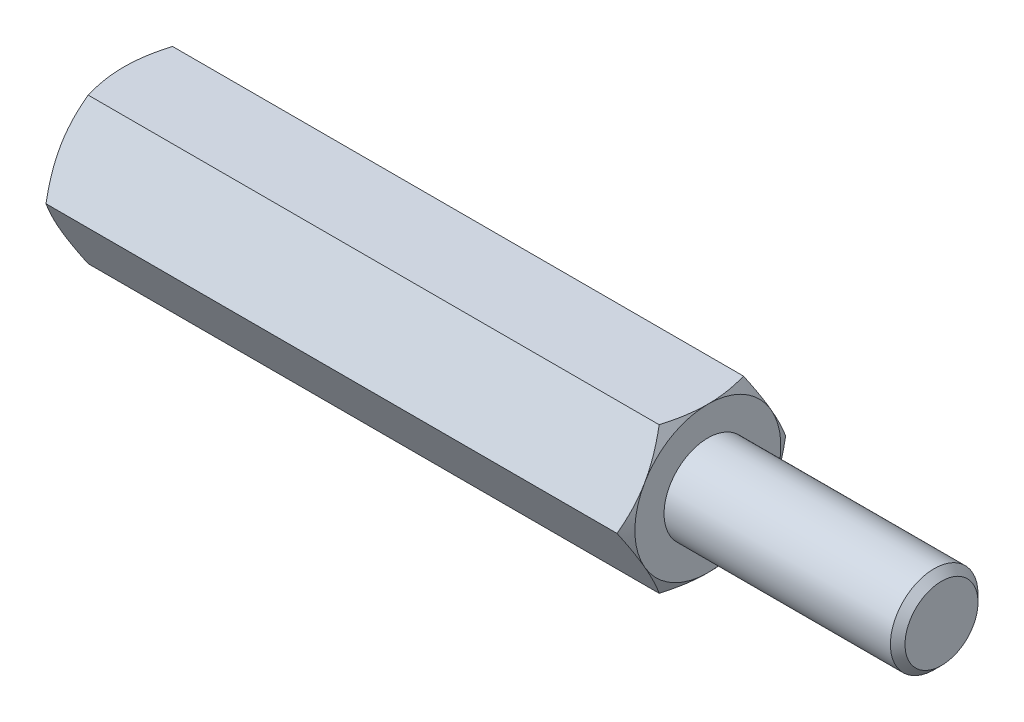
ISO-10303-21;
HEADER;
FILE_DESCRIPTION(('STEP AP214'),'2;1');
FILE_NAME('part.step','',(''),(''),'','','');
FILE_SCHEMA(('AUTOMOTIVE_DESIGN { 1 0 10303 214 1 1 1 1 }'));
ENDSEC;
DATA;
#1=APPLICATION_CONTEXT('core data for automotive mechanical design processes');
#2=APPLICATION_PROTOCOL_DEFINITION('international standard','automotive_design',2000,#1);
#3=PRODUCT_CONTEXT('',#1,'mechanical');
#4=PRODUCT('Part','Part','',(#3));
#5=PRODUCT_RELATED_PRODUCT_CATEGORY('part','',(#4));
#6=PRODUCT_DEFINITION_FORMATION('','',#4);
#7=PRODUCT_DEFINITION_CONTEXT('part definition',#1,'design');
#8=PRODUCT_DEFINITION('design','',#6,#7);
#9=PRODUCT_DEFINITION_SHAPE('','',#8);
#10=(LENGTH_UNIT() NAMED_UNIT(*) SI_UNIT(.MILLI.,.METRE.));
#11=(NAMED_UNIT(*) PLANE_ANGLE_UNIT() SI_UNIT($,.RADIAN.));
#12=(NAMED_UNIT(*) SI_UNIT($,.STERADIAN.) SOLID_ANGLE_UNIT());
#13=UNCERTAINTY_MEASURE_WITH_UNIT(LENGTH_MEASURE(1.E-05),#10,'distance_accuracy_value','');
#14=(GEOMETRIC_REPRESENTATION_CONTEXT(3) GLOBAL_UNCERTAINTY_ASSIGNED_CONTEXT((#13)) GLOBAL_UNIT_ASSIGNED_CONTEXT((#10,
#11,#12)) REPRESENTATION_CONTEXT('',''));
#15=CARTESIAN_POINT('',(0.,0.,0.));
#16=DIRECTION('',(0.,0.,1.));
#17=DIRECTION('',(1.,0.,0.));
#18=AXIS2_PLACEMENT_3D('',#15,#16,#17);
#19=CARTESIAN_POINT('',(10.,2.5,-1.44337567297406));
#20=DIRECTION('',(1.,0.,0.));
#21=DIRECTION('',(0.,0.,-1.));
#22=AXIS2_PLACEMENT_3D('',#19,#20,#21);
#23=PLANE('',#22);
#24=CARTESIAN_POINT('',(10.,0.,0.));
#25=DIRECTION('',(1.,0.,0.));
#26=DIRECTION('',(0.,0.,-1.));
#27=AXIS2_PLACEMENT_3D('',#24,#25,#26);
#28=CIRCLE('',#27,2.5);
#29=CARTESIAN_POINT('',(10.,-1.25,-2.1650635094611));
#30=VERTEX_POINT('',#29);
#31=CARTESIAN_POINT('',(10.,1.25,-2.1650635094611));
#32=VERTEX_POINT('',#31);
#33=EDGE_CURVE('E288',#30,#32,#28,.T.);
#34=ORIENTED_EDGE('',*,*,#33,.T.);
#35=CARTESIAN_POINT('',(10.,2.5,0.));
#36=VERTEX_POINT('',#35);
#37=EDGE_CURVE('E53',#32,#36,#28,.T.);
#38=ORIENTED_EDGE('',*,*,#37,.T.);
#39=CARTESIAN_POINT('',(10.,1.25,2.1650635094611));
#40=VERTEX_POINT('',#39);
#41=EDGE_CURVE('E296',#36,#40,#28,.T.);
#42=ORIENTED_EDGE('',*,*,#41,.T.);
#43=CARTESIAN_POINT('',(10.,-1.25,2.1650635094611));
#44=VERTEX_POINT('',#43);
#45=EDGE_CURVE('E301',#40,#44,#28,.T.);
#46=ORIENTED_EDGE('',*,*,#45,.T.);
#47=CARTESIAN_POINT('',(10.,0.,0.));
#48=DIRECTION('',(-1.,0.,0.));
#49=DIRECTION('',(0.,-1.,0.));
#50=AXIS2_PLACEMENT_3D('',#47,#48,#49);
#51=CIRCLE('',#50,2.5);
#52=CARTESIAN_POINT('',(10.,-2.5,0.));
#53=VERTEX_POINT('',#52);
#54=EDGE_CURVE('E193',#53,#44,#51,.T.);
#55=ORIENTED_EDGE('',*,*,#54,.F.);
#56=EDGE_CURVE('E61',#53,#30,#28,.T.);
#57=ORIENTED_EDGE('',*,*,#56,.T.);
#58=EDGE_LOOP('',(#34,#38,#42,#46,#55,#57));
#59=FACE_BOUND('',#58,.T.);
#60=CARTESIAN_POINT('',(10.,0.,0.));
#61=DIRECTION('',(1.,0.,0.));
#62=DIRECTION('',(0.,0.,-1.));
#63=AXIS2_PLACEMENT_3D('',#60,#61,#62);
#64=CIRCLE('',#63,1.5);
#65=CARTESIAN_POINT('',(10.,0.,-1.5));
#66=VERTEX_POINT('',#65);
#67=EDGE_CURVE('E329',#66,#66,#64,.T.);
#68=ORIENTED_EDGE('',*,*,#67,.F.);
#69=EDGE_LOOP('',(#68));
#70=FACE_BOUND('',#69,.T.);
#71=ADVANCED_FACE('F37',(#59,#70),#23,.T.);
#72=CARTESIAN_POINT('',(10.,0.,-2.88675134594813));
#73=DIRECTION('',(0.,-0.5,0.866025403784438));
#74=DIRECTION('',(0.,-0.866025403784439,-0.5));
#75=AXIS2_PLACEMENT_3D('',#72,#73,#74);
#76=PLANE('',#75);
#77=CARTESIAN_POINT('',(9.7766423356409,-0.00019999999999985,-2.88686681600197));
#78=CARTESIAN_POINT('',(9.81327837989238,0.109663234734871,-2.82343724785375));
#79=CARTESIAN_POINT('',(9.84659778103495,0.220474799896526,-2.75946016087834));
#80=CARTESIAN_POINT('',(9.90475771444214,0.444016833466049,-2.63039810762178));
#81=CARTESIAN_POINT('',(9.92957767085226,0.556751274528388,-2.5653108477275));
#82=CARTESIAN_POINT('',(9.96821434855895,0.780822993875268,-2.43594298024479));
#83=CARTESIAN_POINT('',(9.98228820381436,0.892125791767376,-2.37168227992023));
#84=CARTESIAN_POINT('',(9.99909084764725,1.11525522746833,-2.24285844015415));
#85=CARTESIAN_POINT('',(10.0018335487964,1.22708105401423,-2.17829576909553));
#86=CARTESIAN_POINT('',(9.99613423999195,1.43604197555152,-2.05765212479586));
#87=CARTESIAN_POINT('',(9.98909160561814,1.53320831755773,-2.0015531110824));
#88=CARTESIAN_POINT('',(9.96676858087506,1.726907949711,-1.88972057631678));
#89=CARTESIAN_POINT('',(9.95148056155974,1.82344056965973,-1.8339874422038));
#90=CARTESIAN_POINT('',(9.91326090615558,2.01753972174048,-1.7219242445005));
#91=CARTESIAN_POINT('',(9.89016722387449,2.11508168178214,-1.66560836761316));
#92=CARTESIAN_POINT('',(9.83775334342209,2.30871060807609,-1.55381665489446));
#93=CARTESIAN_POINT('',(9.80844546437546,2.40480005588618,-1.49833938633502));
#94=CARTESIAN_POINT('',(9.7766423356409,2.5002,-1.44326020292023));
#95=B_SPLINE_CURVE_WITH_KNOTS('',3,(#77,#78,#79,#80,#81,#82,#83,#84,#85,#86,#87,#88,#89,#90,#91,
#92,#93,#94),.UNSPECIFIED.,.F.,.F.,(4,2,2,2,2,2,2,2,4),(0.,0.396285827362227,0.79352433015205,
1.18093086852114,1.56786160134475,1.90479741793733,2.24204551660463,2.58677531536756,
2.93082800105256),.UNSPECIFIED.);
#96=CARTESIAN_POINT('',(9.7767090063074,0.,-2.88675134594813));
#97=VERTEX_POINT('',#96);
#98=EDGE_CURVE('E336',#97,#32,#95,.T.);
#99=ORIENTED_EDGE('',*,*,#98,.F.);
#100=DIRECTION('',(-1.,0.,0.));
#101=VECTOR('',#100,1.);
#102=CARTESIAN_POINT('',(10.,0.,-2.88675134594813));
#103=LINE('',#102,#101);
#104=CARTESIAN_POINT('',(-9.7767090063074,0.,-2.88675134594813));
#105=VERTEX_POINT('',#104);
#106=EDGE_CURVE('E264',#97,#105,#103,.T.);
#107=ORIENTED_EDGE('',*,*,#106,.T.);
#108=CARTESIAN_POINT('',(-9.7766423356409,2.5002,-1.44326020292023));
#109=CARTESIAN_POINT('',(-9.81327837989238,2.39033676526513,-1.50668977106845));
#110=CARTESIAN_POINT('',(-9.84659778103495,2.27952520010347,-1.57066685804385));
#111=CARTESIAN_POINT('',(-9.90475771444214,2.05598316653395,-1.69972891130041));
#112=CARTESIAN_POINT('',(-9.92957767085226,1.94324872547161,-1.7648161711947));
#113=CARTESIAN_POINT('',(-9.96821434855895,1.71917700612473,-1.8941840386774));
#114=CARTESIAN_POINT('',(-9.98228820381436,1.60787420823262,-1.95844473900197));
#115=CARTESIAN_POINT('',(-9.99909084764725,1.38474477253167,-2.08726857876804));
#116=CARTESIAN_POINT('',(-10.0018335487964,1.27291894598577,-2.15183124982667));
#117=CARTESIAN_POINT('',(-9.99613423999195,1.06395802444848,-2.27247489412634));
#118=CARTESIAN_POINT('',(-9.98909160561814,0.96679168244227,-2.32857390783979));
#119=CARTESIAN_POINT('',(-9.96676858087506,0.773092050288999,-2.44040644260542));
#120=CARTESIAN_POINT('',(-9.95148056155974,0.676559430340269,-2.49613957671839));
#121=CARTESIAN_POINT('',(-9.91326090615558,0.482460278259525,-2.60820277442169));
#122=CARTESIAN_POINT('',(-9.89016722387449,0.38491831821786,-2.66451865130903));
#123=CARTESIAN_POINT('',(-9.83775334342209,0.191289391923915,-2.77631036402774));
#124=CARTESIAN_POINT('',(-9.80844546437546,0.0951999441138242,-2.83178763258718));
#125=CARTESIAN_POINT('',(-9.7766423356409,-0.000199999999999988,-2.88686681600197));
#126=B_SPLINE_CURVE_WITH_KNOTS('',3,(#108,#109,#110,#111,#112,#113,#114,#115,#116,#117,#118,
#119,#120,#121,#122,#123,#124,#125),.UNSPECIFIED.,.F.,.F.,(4,2,2,2,2,2,2,2,4),(0.,
0.396285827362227,0.79352433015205,1.18093086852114,1.56786160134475,1.90479741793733,
2.24204551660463,2.58677531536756,2.93082800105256),.UNSPECIFIED.);
#127=CARTESIAN_POINT('',(-10.,1.25,-2.1650635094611));
#128=VERTEX_POINT('',#127);
#129=EDGE_CURVE('E321',#128,#105,#126,.T.);
#130=ORIENTED_EDGE('',*,*,#129,.F.);
#131=CARTESIAN_POINT('',(-9.7767090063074,2.5,-1.44337567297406));
#132=VERTEX_POINT('',#131);
#133=EDGE_CURVE('E311',#132,#128,#126,.T.);
#134=ORIENTED_EDGE('',*,*,#133,.F.);
#135=DIRECTION('',(-1.,0.,0.));
#136=VECTOR('',#135,1.);
#137=CARTESIAN_POINT('',(10.,2.5,-1.44337567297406));
#138=LINE('',#137,#136);
#139=CARTESIAN_POINT('',(9.77670900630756,2.5,-1.44337567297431));
#140=VERTEX_POINT('',#139);
#141=EDGE_CURVE('E279',#140,#132,#138,.T.);
#142=ORIENTED_EDGE('',*,*,#141,.F.);
#143=EDGE_CURVE('E229',#32,#140,#95,.T.);
#144=ORIENTED_EDGE('',*,*,#143,.F.);
#145=EDGE_LOOP('',(#99,#107,#130,#134,#142,#144));
#146=FACE_BOUND('',#145,.T.);
#147=ADVANCED_FACE('F148',(#146),#76,.F.);
#148=CARTESIAN_POINT('',(10.,2.5,-1.44337567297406));
#149=DIRECTION('',(0.,-1.,0.));
#150=DIRECTION('',(0.,0.,-1.));
#151=AXIS2_PLACEMENT_3D('',#148,#149,#150);
#152=PLANE('',#151);
#153=CARTESIAN_POINT('',(8.76803388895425,2.5,-3.90158441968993));
#154=CARTESIAN_POINT('',(8.82120772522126,2.5,-3.79217004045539));
#155=CARTESIAN_POINT('',(8.87387869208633,2.5,-3.68250707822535));
#156=CARTESIAN_POINT('',(8.97793249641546,2.5,-3.46255185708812));
#157=CARTESIAN_POINT('',(9.02931513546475,2.5,-3.35225950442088));
#158=CARTESIAN_POINT('',(9.13076309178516,2.5,-3.130356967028));
#159=CARTESIAN_POINT('',(9.18081992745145,2.5,-3.01874289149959));
#160=CARTESIAN_POINT('',(9.27891712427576,2.5,-2.79463535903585));
#161=CARTESIAN_POINT('',(9.32695757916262,2.5,-2.68214194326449));
#162=CARTESIAN_POINT('',(9.42201845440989,2.5,-2.45240385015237));
#163=CARTESIAN_POINT('',(9.46895431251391,2.5,-2.33512399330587));
#164=CARTESIAN_POINT('',(9.55933269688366,2.5,-2.09920133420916));
#165=CARTESIAN_POINT('',(9.60277483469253,2.5,-1.98055838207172));
#166=CARTESIAN_POINT('',(9.68504351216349,2.5,-1.74193489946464));
#167=CARTESIAN_POINT('',(9.72387917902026,2.5,-1.6219575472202));
#168=CARTESIAN_POINT('',(9.79570507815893,2.5,-1.38028205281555));
#169=CARTESIAN_POINT('',(9.82869712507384,2.5,-1.25858445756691));
#170=CARTESIAN_POINT('',(9.88709594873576,2.5,-1.01406369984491));
#171=CARTESIAN_POINT('',(9.91254379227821,2.5,-0.89125052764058));
#172=CARTESIAN_POINT('',(9.95442751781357,2.5,-0.644071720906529));
#173=CARTESIAN_POINT('',(9.97086432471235,2.5,-0.519706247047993));
#174=CARTESIAN_POINT('',(9.9932006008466,2.5,-0.271679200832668));
#175=CARTESIAN_POINT('',(9.99923751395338,2.5,-0.148030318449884));
#176=CARTESIAN_POINT('',(10.0006256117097,2.5,0.0993395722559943));
#177=CARTESIAN_POINT('',(9.99597656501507,2.5,0.223060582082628));
#178=CARTESIAN_POINT('',(9.97940443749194,2.5,0.432351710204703));
#179=CARTESIAN_POINT('',(9.97010665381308,2.5,0.518143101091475));
#180=CARTESIAN_POINT('',(9.94693847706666,2.5,0.689112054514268));
#181=CARTESIAN_POINT('',(9.93306748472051,2.5,0.77428953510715));
#182=CARTESIAN_POINT('',(9.88532020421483,2.5,1.02876599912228));
#183=CARTESIAN_POINT('',(9.84531764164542,2.5,1.19691958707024));
#184=CARTESIAN_POINT('',(9.75226567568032,2.5,1.53362893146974));
#185=CARTESIAN_POINT('',(9.69893620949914,2.5,1.70210423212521));
#186=CARTESIAN_POINT('',(9.61237169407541,2.5,1.95247339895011));
#187=CARTESIAN_POINT('',(9.58242477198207,2.5,2.03553184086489));
#188=CARTESIAN_POINT('',(9.52068409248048,2.5,2.20095860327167));
#189=CARTESIAN_POINT('',(9.48889037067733,2.5,2.2833269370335));
#190=CARTESIAN_POINT('',(9.40401426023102,2.5,2.49723312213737));
#191=CARTESIAN_POINT('',(9.34971733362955,2.5,2.6282879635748));
#192=CARTESIAN_POINT('',(9.2381273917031,2.5,2.88912034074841));
#193=CARTESIAN_POINT('',(9.1808341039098,2.5,3.01889775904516));
#194=CARTESIAN_POINT('',(9.06393487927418,2.5,3.27745045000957));
#195=CARTESIAN_POINT('',(9.00432825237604,2.5,3.40622540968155));
#196=CARTESIAN_POINT('',(8.8833234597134,2.5,3.66293235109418));
#197=CARTESIAN_POINT('',(8.82192524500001,2.5,3.79086430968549));
#198=CARTESIAN_POINT('',(8.63545801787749,2.5,4.17399495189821));
#199=CARTESIAN_POINT('',(8.50828249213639,2.5,4.42816724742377));
#200=CARTESIAN_POINT('',(8.25034557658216,2.5,4.93461464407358));
#201=CARTESIAN_POINT('',(8.11958483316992,2.5,5.18689007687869));
#202=CARTESIAN_POINT('',(7.86871001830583,2.5,5.66512451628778));
#203=CARTESIAN_POINT('',(7.74882986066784,2.5,5.89120644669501));
#204=CARTESIAN_POINT('',(7.50759021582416,2.5,6.34259369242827));
#205=CARTESIAN_POINT('',(7.38623065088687,2.5,6.56789896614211));
#206=CARTESIAN_POINT('',(7.14278038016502,2.5,7.01722044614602));
#207=CARTESIAN_POINT('',(7.02069305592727,2.5,7.24123848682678));
#208=CARTESIAN_POINT('',(6.77566624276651,2.5,7.68878772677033));
#209=CARTESIAN_POINT('',(6.65272681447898,2.5,7.9123189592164));
#210=CARTESIAN_POINT('',(6.52947566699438,2.5,8.13567697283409));
#211=B_SPLINE_CURVE_WITH_KNOTS('',3,(#153,#154,#155,#156,#157,#158,#159,#160,#161,#162,#163,
#164,#165,#166,#167,#168,#169,#170,#171,#172,#173,#174,#175,#176,#177,#178,#179,#180,#181,#182,
#183,#184,#185,#186,#187,#188,#189,#190,#191,#192,#193,#194,#195,#196,#197,#198,#199,#200,#201,
#202,#203,#204,#205,#206,#207,#208,#209,#210),.UNSPECIFIED.,.F.,.F.,(4,2,2,2,2,2,2,2,2,2,2,2,2,
2,2,2,2,2,2,2,2,2,2,2,2,2,2,2,4),(0.,0.364957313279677,0.729970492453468,1.09692930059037,
1.46387103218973,1.84279746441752,2.22176597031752,2.59997058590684,2.97805755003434,
3.35404692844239,3.72999770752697,4.10094071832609,4.47189175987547,4.73064905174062,
4.98944026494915,5.5072907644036,6.03710483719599,6.30196454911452,6.56681915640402,
6.99233818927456,7.41789598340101,7.84358170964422,8.26927907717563,9.12186602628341,
9.97430025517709,10.7419897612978,11.5097197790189,12.2750964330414,13.0404191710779),.UNSPECIFIED.);
#212=EDGE_CURVE('E227',#140,#36,#211,.T.);
#213=ORIENTED_EDGE('',*,*,#212,.F.);
#214=ORIENTED_EDGE('',*,*,#141,.T.);
#215=CARTESIAN_POINT('',(-8.76803388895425,2.5,-3.90158441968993));
#216=CARTESIAN_POINT('',(-8.82120772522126,2.5,-3.79217004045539));
#217=CARTESIAN_POINT('',(-8.87387869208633,2.5,-3.68250707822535));
#218=CARTESIAN_POINT('',(-8.97793249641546,2.5,-3.46255185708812));
#219=CARTESIAN_POINT('',(-9.02931513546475,2.5,-3.35225950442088));
#220=CARTESIAN_POINT('',(-9.13076309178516,2.5,-3.130356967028));
#221=CARTESIAN_POINT('',(-9.18081992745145,2.5,-3.01874289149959));
#222=CARTESIAN_POINT('',(-9.27891712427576,2.5,-2.79463535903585));
#223=CARTESIAN_POINT('',(-9.32695757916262,2.5,-2.68214194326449));
#224=CARTESIAN_POINT('',(-9.42201845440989,2.5,-2.45240385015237));
#225=CARTESIAN_POINT('',(-9.46895431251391,2.5,-2.33512399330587));
#226=CARTESIAN_POINT('',(-9.55933269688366,2.5,-2.09920133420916));
#227=CARTESIAN_POINT('',(-9.60277483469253,2.5,-1.98055838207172));
#228=CARTESIAN_POINT('',(-9.68504351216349,2.5,-1.74193489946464));
#229=CARTESIAN_POINT('',(-9.72387917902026,2.5,-1.6219575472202));
#230=CARTESIAN_POINT('',(-9.79570507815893,2.5,-1.38028205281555));
#231=CARTESIAN_POINT('',(-9.82869712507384,2.5,-1.25858445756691));
#232=CARTESIAN_POINT('',(-9.88709594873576,2.5,-1.01406369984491));
#233=CARTESIAN_POINT('',(-9.91254379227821,2.5,-0.89125052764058));
#234=CARTESIAN_POINT('',(-9.95442751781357,2.5,-0.644071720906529));
#235=CARTESIAN_POINT('',(-9.97086432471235,2.5,-0.519706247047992));
#236=CARTESIAN_POINT('',(-9.9932006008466,2.5,-0.271679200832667));
#237=CARTESIAN_POINT('',(-9.99923751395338,2.5,-0.148030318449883));
#238=CARTESIAN_POINT('',(-10.0006256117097,2.5,0.0993395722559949));
#239=CARTESIAN_POINT('',(-9.99597656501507,2.5,0.223060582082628));
#240=CARTESIAN_POINT('',(-9.97940443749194,2.5,0.432351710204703));
#241=CARTESIAN_POINT('',(-9.97010665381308,2.5,0.518143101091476));
#242=CARTESIAN_POINT('',(-9.94693847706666,2.5,0.689112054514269));
#243=CARTESIAN_POINT('',(-9.93306748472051,2.5,0.774289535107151));
#244=CARTESIAN_POINT('',(-9.88532020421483,2.5,1.02876599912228));
#245=CARTESIAN_POINT('',(-9.84531764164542,2.5,1.19691958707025));
#246=CARTESIAN_POINT('',(-9.75226567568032,2.5,1.53362893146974));
#247=CARTESIAN_POINT('',(-9.69893620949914,2.5,1.70210423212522));
#248=CARTESIAN_POINT('',(-9.61237169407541,2.5,1.95247339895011));
#249=CARTESIAN_POINT('',(-9.58242477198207,2.5,2.03553184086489));
#250=CARTESIAN_POINT('',(-9.52068409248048,2.5,2.20095860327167));
#251=CARTESIAN_POINT('',(-9.48889037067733,2.5,2.2833269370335));
#252=CARTESIAN_POINT('',(-9.40401426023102,2.5,2.49723312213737));
#253=CARTESIAN_POINT('',(-9.34971733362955,2.5,2.6282879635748));
#254=CARTESIAN_POINT('',(-9.2381273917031,2.5,2.88912034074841));
#255=CARTESIAN_POINT('',(-9.1808341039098,2.5,3.01889775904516));
#256=CARTESIAN_POINT('',(-9.06393487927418,2.5,3.27745045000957));
#257=CARTESIAN_POINT('',(-9.00432825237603,2.5,3.40622540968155));
#258=CARTESIAN_POINT('',(-8.8833234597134,2.5,3.66293235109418));
#259=CARTESIAN_POINT('',(-8.82192524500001,2.5,3.79086430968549));
#260=CARTESIAN_POINT('',(-8.6354580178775,2.5,4.17399495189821));
#261=CARTESIAN_POINT('',(-8.50828249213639,2.5,4.42816724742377));
#262=CARTESIAN_POINT('',(-8.25034557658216,2.5,4.93461464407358));
#263=CARTESIAN_POINT('',(-8.11958483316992,2.5,5.18689007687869));
#264=CARTESIAN_POINT('',(-7.86871001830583,2.5,5.66512451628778));
#265=CARTESIAN_POINT('',(-7.74882986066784,2.5,5.89120644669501));
#266=CARTESIAN_POINT('',(-7.50759021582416,2.5,6.34259369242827));
#267=CARTESIAN_POINT('',(-7.38623065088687,2.5,6.56789896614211));
#268=CARTESIAN_POINT('',(-7.14278038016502,2.5,7.01722044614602));
#269=CARTESIAN_POINT('',(-7.02069305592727,2.5,7.24123848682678));
#270=CARTESIAN_POINT('',(-6.77566624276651,2.5,7.68878772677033));
#271=CARTESIAN_POINT('',(-6.65272681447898,2.5,7.9123189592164));
#272=CARTESIAN_POINT('',(-6.52947566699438,2.5,8.13567697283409));
#273=B_SPLINE_CURVE_WITH_KNOTS('',3,(#215,#216,#217,#218,#219,#220,#221,#222,#223,#224,#225,
#226,#227,#228,#229,#230,#231,#232,#233,#234,#235,#236,#237,#238,#239,#240,#241,#242,#243,#244,
#245,#246,#247,#248,#249,#250,#251,#252,#253,#254,#255,#256,#257,#258,#259,#260,#261,#262,#263,
#264,#265,#266,#267,#268,#269,#270,#271,#272),.UNSPECIFIED.,.F.,.F.,(4,2,2,2,2,2,2,2,2,2,2,2,2,
2,2,2,2,2,2,2,2,2,2,2,2,2,2,2,4),(0.,0.364957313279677,0.729970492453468,1.09692930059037,
1.46387103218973,1.84279746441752,2.22176597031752,2.59997058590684,2.97805755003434,
3.35404692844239,3.72999770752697,4.10094071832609,4.47189175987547,4.73064905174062,
4.98944026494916,5.5072907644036,6.03710483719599,6.30196454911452,6.56681915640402,
6.99233818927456,7.41789598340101,7.84358170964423,8.26927907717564,9.12186602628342,
9.9743002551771,10.7419897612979,11.5097197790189,12.2750964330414,13.0404191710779),.UNSPECIFIED.);
#274=CARTESIAN_POINT('',(-10.,2.5,0.));
#275=VERTEX_POINT('',#274);
#276=EDGE_CURVE('E241',#275,#132,#273,.F.);
#277=ORIENTED_EDGE('',*,*,#276,.F.);
#278=CARTESIAN_POINT('',(-9.7767090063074,2.5,1.44337567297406));
#279=VERTEX_POINT('',#278);
#280=EDGE_CURVE('E249',#279,#275,#273,.F.);
#281=ORIENTED_EDGE('',*,*,#280,.F.);
#282=DIRECTION('',(-1.,0.,0.));
#283=VECTOR('',#282,1.);
#284=CARTESIAN_POINT('',(10.,2.5,1.44337567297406));
#285=LINE('',#284,#283);
#286=CARTESIAN_POINT('',(9.7767090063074,2.5,1.44337567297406));
#287=VERTEX_POINT('',#286);
#288=EDGE_CURVE('E276',#287,#279,#285,.T.);
#289=ORIENTED_EDGE('',*,*,#288,.F.);
#290=EDGE_CURVE('E221',#36,#287,#211,.T.);
#291=ORIENTED_EDGE('',*,*,#290,.F.);
#292=EDGE_LOOP('',(#213,#214,#277,#281,#289,#291));
#293=FACE_BOUND('',#292,.T.);
#294=ADVANCED_FACE('F153',(#293),#152,.F.);
#295=CARTESIAN_POINT('',(10.,2.5,1.44337567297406));
#296=DIRECTION('',(0.,-0.5,-0.866025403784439));
#297=DIRECTION('',(0.,0.866025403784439,-0.5));
#298=AXIS2_PLACEMENT_3D('',#295,#296,#297);
#299=PLANE('',#298);
#300=CARTESIAN_POINT('',(9.7766423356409,2.5002,1.44326020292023));
#301=CARTESIAN_POINT('',(9.81327837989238,2.39033676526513,1.50668977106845));
#302=CARTESIAN_POINT('',(9.84659778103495,2.27952520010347,1.57066685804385));
#303=CARTESIAN_POINT('',(9.90475771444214,2.05598316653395,1.69972891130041));
#304=CARTESIAN_POINT('',(9.92957767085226,1.94324872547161,1.7648161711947));
#305=CARTESIAN_POINT('',(9.96821434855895,1.71917700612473,1.8941840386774));
#306=CARTESIAN_POINT('',(9.98228820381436,1.60787420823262,1.95844473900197));
#307=CARTESIAN_POINT('',(9.99909084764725,1.38474477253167,2.08726857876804));
#308=CARTESIAN_POINT('',(10.0018335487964,1.27291894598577,2.15183124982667));
#309=CARTESIAN_POINT('',(9.99613423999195,1.06395802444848,2.27247489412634));
#310=CARTESIAN_POINT('',(9.98909160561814,0.96679168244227,2.32857390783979));
#311=CARTESIAN_POINT('',(9.96676858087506,0.773092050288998,2.44040644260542));
#312=CARTESIAN_POINT('',(9.95148056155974,0.676559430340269,2.49613957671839));
#313=CARTESIAN_POINT('',(9.91326090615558,0.482460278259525,2.60820277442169));
#314=CARTESIAN_POINT('',(9.89016722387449,0.38491831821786,2.66451865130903));
#315=CARTESIAN_POINT('',(9.83775334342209,0.191289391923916,2.77631036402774));
#316=CARTESIAN_POINT('',(9.80844546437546,0.0951999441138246,2.83178763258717));
#317=CARTESIAN_POINT('',(9.7766423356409,-0.000199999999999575,2.88686681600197));
#318=B_SPLINE_CURVE_WITH_KNOTS('',3,(#300,#301,#302,#303,#304,#305,#306,#307,#308,#309,#310,
#311,#312,#313,#314,#315,#316,#317),.UNSPECIFIED.,.F.,.F.,(4,2,2,2,2,2,2,2,4),(0.,
0.396285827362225,0.79352433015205,1.18093086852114,1.56786160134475,1.90479741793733,
2.24204551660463,2.58677531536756,2.93082800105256),.UNSPECIFIED.);
#319=EDGE_CURVE('E228',#287,#40,#318,.T.);
#320=ORIENTED_EDGE('',*,*,#319,.F.);
#321=ORIENTED_EDGE('',*,*,#288,.T.);
#322=CARTESIAN_POINT('',(-9.7766423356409,-0.000199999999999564,2.88686681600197));
#323=CARTESIAN_POINT('',(-9.81327837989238,0.109663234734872,2.82343724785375));
#324=CARTESIAN_POINT('',(-9.84659778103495,0.220474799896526,2.75946016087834));
#325=CARTESIAN_POINT('',(-9.90475771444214,0.444016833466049,2.63039810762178));
#326=CARTESIAN_POINT('',(-9.92957767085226,0.556751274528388,2.5653108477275));
#327=CARTESIAN_POINT('',(-9.96821434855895,0.780822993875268,2.43594298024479));
#328=CARTESIAN_POINT('',(-9.98228820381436,0.892125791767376,2.37168227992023));
#329=CARTESIAN_POINT('',(-9.99909084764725,1.11525522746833,2.24285844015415));
#330=CARTESIAN_POINT('',(-10.0018335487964,1.22708105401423,2.17829576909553));
#331=CARTESIAN_POINT('',(-9.99613423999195,1.43604197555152,2.05765212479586));
#332=CARTESIAN_POINT('',(-9.98909160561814,1.53320831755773,2.0015531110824));
#333=CARTESIAN_POINT('',(-9.96676858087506,1.726907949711,1.88972057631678));
#334=CARTESIAN_POINT('',(-9.95148056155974,1.82344056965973,1.8339874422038));
#335=CARTESIAN_POINT('',(-9.91326090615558,2.01753972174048,1.7219242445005));
#336=CARTESIAN_POINT('',(-9.89016722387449,2.11508168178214,1.66560836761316));
#337=CARTESIAN_POINT('',(-9.83775334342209,2.30871060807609,1.55381665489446));
#338=CARTESIAN_POINT('',(-9.80844546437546,2.40480005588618,1.49833938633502));
#339=CARTESIAN_POINT('',(-9.7766423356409,2.5002,1.44326020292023));
#340=B_SPLINE_CURVE_WITH_KNOTS('',3,(#322,#323,#324,#325,#326,#327,#328,#329,#330,#331,#332,
#333,#334,#335,#336,#337,#338,#339),.UNSPECIFIED.,.F.,.F.,(4,2,2,2,2,2,2,2,4),(0.,
0.396285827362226,0.793524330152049,1.18093086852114,1.56786160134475,1.90479741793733,
2.24204551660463,2.58677531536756,2.93082800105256),.UNSPECIFIED.);
#341=CARTESIAN_POINT('',(-10.,1.25,2.1650635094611));
#342=VERTEX_POINT('',#341);
#343=EDGE_CURVE('E255',#342,#279,#340,.T.);
#344=ORIENTED_EDGE('',*,*,#343,.F.);
#345=CARTESIAN_POINT('',(-9.7767090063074,0.,2.88675134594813));
#346=VERTEX_POINT('',#345);
#347=EDGE_CURVE('E262',#346,#342,#340,.T.);
#348=ORIENTED_EDGE('',*,*,#347,.F.);
#349=DIRECTION('',(-1.,0.,0.));
#350=VECTOR('',#349,1.);
#351=CARTESIAN_POINT('',(10.,0.,2.88675134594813));
#352=LINE('',#351,#350);
#353=CARTESIAN_POINT('',(9.7767090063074,0.,2.88675134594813));
#354=VERTEX_POINT('',#353);
#355=EDGE_CURVE('E273',#354,#346,#352,.T.);
#356=ORIENTED_EDGE('',*,*,#355,.F.);
#357=EDGE_CURVE('E215',#40,#354,#318,.T.);
#358=ORIENTED_EDGE('',*,*,#357,.F.);
#359=EDGE_LOOP('',(#320,#321,#344,#348,#356,#358));
#360=FACE_BOUND('',#359,.T.);
#361=ADVANCED_FACE('F235',(#360),#299,.F.);
#362=CARTESIAN_POINT('',(10.,0.,2.88675134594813));
#363=DIRECTION('',(0.,0.5,-0.866025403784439));
#364=DIRECTION('',(0.,0.866025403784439,0.5));
#365=AXIS2_PLACEMENT_3D('',#362,#363,#364);
#366=PLANE('',#365);
#367=CARTESIAN_POINT('',(9.7766423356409,0.000200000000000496,2.88686681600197));
#368=CARTESIAN_POINT('',(9.81327837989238,-0.10966323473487,2.82343724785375));
#369=CARTESIAN_POINT('',(9.84659778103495,-0.220474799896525,2.75946016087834));
#370=CARTESIAN_POINT('',(9.90475771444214,-0.444016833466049,2.63039810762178));
#371=CARTESIAN_POINT('',(9.92957767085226,-0.556751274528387,2.5653108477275));
#372=CARTESIAN_POINT('',(9.96821434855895,-0.780822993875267,2.43594298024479));
#373=CARTESIAN_POINT('',(9.98228820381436,-0.892125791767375,2.37168227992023));
#374=CARTESIAN_POINT('',(9.99909084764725,-1.11525522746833,2.24285844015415));
#375=CARTESIAN_POINT('',(10.0018335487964,-1.22708105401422,2.17829576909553));
#376=CARTESIAN_POINT('',(9.99613423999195,-1.43604197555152,2.05765212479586));
#377=CARTESIAN_POINT('',(9.98909160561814,-1.53320831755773,2.0015531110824));
#378=CARTESIAN_POINT('',(9.96676858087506,-1.726907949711,1.88972057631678));
#379=CARTESIAN_POINT('',(9.95148056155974,-1.82344056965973,1.8339874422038));
#380=CARTESIAN_POINT('',(9.91326090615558,-2.01753972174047,1.7219242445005));
#381=CARTESIAN_POINT('',(9.89016722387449,-2.11508168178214,1.66560836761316));
#382=CARTESIAN_POINT('',(9.83775334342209,-2.30871060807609,1.55381665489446));
#383=CARTESIAN_POINT('',(9.80844546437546,-2.40480005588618,1.49833938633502));
#384=CARTESIAN_POINT('',(9.7766423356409,-2.5002,1.44326020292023));
#385=B_SPLINE_CURVE_WITH_KNOTS('',3,(#367,#368,#369,#370,#371,#372,#373,#374,#375,#376,#377,
#378,#379,#380,#381,#382,#383,#384),.UNSPECIFIED.,.F.,.F.,(4,2,2,2,2,2,2,2,4),(0.,
0.396285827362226,0.79352433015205,1.18093086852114,1.56786160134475,1.90479741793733,
2.24204551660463,2.58677531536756,2.93082800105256),.UNSPECIFIED.);
#386=EDGE_CURVE('E350',#354,#44,#385,.T.);
#387=ORIENTED_EDGE('',*,*,#386,.F.);
#388=ORIENTED_EDGE('',*,*,#355,.T.);
#389=CARTESIAN_POINT('',(-9.7766423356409,-2.5002,1.44326020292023));
#390=CARTESIAN_POINT('',(-9.81327837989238,-2.39033676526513,1.50668977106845));
#391=CARTESIAN_POINT('',(-9.84659778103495,-2.27952520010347,1.57066685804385));
#392=CARTESIAN_POINT('',(-9.90475771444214,-2.05598316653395,1.69972891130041));
#393=CARTESIAN_POINT('',(-9.92957767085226,-1.94324872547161,1.7648161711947));
#394=CARTESIAN_POINT('',(-9.96821434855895,-1.71917700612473,1.8941840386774));
#395=CARTESIAN_POINT('',(-9.98228820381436,-1.60787420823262,1.95844473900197));
#396=CARTESIAN_POINT('',(-9.99909084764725,-1.38474477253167,2.08726857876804));
#397=CARTESIAN_POINT('',(-10.0018335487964,-1.27291894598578,2.15183124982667));
#398=CARTESIAN_POINT('',(-9.99613423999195,-1.06395802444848,2.27247489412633));
#399=CARTESIAN_POINT('',(-9.98909160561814,-0.966791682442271,2.32857390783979));
#400=CARTESIAN_POINT('',(-9.96676858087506,-0.773092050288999,2.44040644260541));
#401=CARTESIAN_POINT('',(-9.95148056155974,-0.676559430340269,2.49613957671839));
#402=CARTESIAN_POINT('',(-9.91326090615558,-0.482460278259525,2.60820277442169));
#403=CARTESIAN_POINT('',(-9.89016722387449,-0.38491831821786,2.66451865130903));
#404=CARTESIAN_POINT('',(-9.83775334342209,-0.191289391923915,2.77631036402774));
#405=CARTESIAN_POINT('',(-9.80844546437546,-0.0951999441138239,2.83178763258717));
#406=CARTESIAN_POINT('',(-9.7766423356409,0.000200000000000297,2.88686681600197));
#407=B_SPLINE_CURVE_WITH_KNOTS('',3,(#389,#390,#391,#392,#393,#394,#395,#396,#397,#398,#399,
#400,#401,#402,#403,#404,#405,#406),.UNSPECIFIED.,.F.,.F.,(4,2,2,2,2,2,2,2,4),(0.,
0.396285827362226,0.793524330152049,1.18093086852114,1.56786160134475,1.90479741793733,
2.24204551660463,2.58677531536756,2.93082800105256),.UNSPECIFIED.);
#408=CARTESIAN_POINT('',(-10.,-1.25,2.1650635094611));
#409=VERTEX_POINT('',#408);
#410=EDGE_CURVE('E263',#409,#346,#407,.T.);
#411=ORIENTED_EDGE('',*,*,#410,.F.);
#412=CARTESIAN_POINT('',(-9.7767090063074,-2.5,1.44337567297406));
#413=VERTEX_POINT('',#412);
#414=EDGE_CURVE('E250',#413,#409,#407,.T.);
#415=ORIENTED_EDGE('',*,*,#414,.F.);
#416=DIRECTION('',(-1.,0.,0.));
#417=VECTOR('',#416,1.);
#418=CARTESIAN_POINT('',(10.,-2.5,1.44337567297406));
#419=LINE('',#418,#417);
#420=CARTESIAN_POINT('',(9.7767090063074,-2.5,1.44337567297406));
#421=VERTEX_POINT('',#420);
#422=EDGE_CURVE('E270',#421,#413,#419,.T.);
#423=ORIENTED_EDGE('',*,*,#422,.F.);
#424=EDGE_CURVE('E210',#44,#421,#385,.T.);
#425=ORIENTED_EDGE('',*,*,#424,.F.);
#426=EDGE_LOOP('',(#387,#388,#411,#415,#423,#425));
#427=FACE_BOUND('',#426,.T.);
#428=ADVANCED_FACE('F424',(#427),#366,.F.);
#429=CARTESIAN_POINT('',(10.,-2.5,1.44337567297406));
#430=DIRECTION('',(0.,1.,0.));
#431=DIRECTION('',(0.,0.,1.));
#432=AXIS2_PLACEMENT_3D('',#429,#430,#431);
#433=PLANE('',#432);
#434=CARTESIAN_POINT('',(8.76803388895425,-2.5,-3.90158441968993));
#435=CARTESIAN_POINT('',(8.82120772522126,-2.5,-3.79217004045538));
#436=CARTESIAN_POINT('',(8.87387869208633,-2.5,-3.68250707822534));
#437=CARTESIAN_POINT('',(8.97793249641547,-2.5,-3.46255185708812));
#438=CARTESIAN_POINT('',(9.02931513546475,-2.5,-3.35225950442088));
#439=CARTESIAN_POINT('',(9.13076309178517,-2.5,-3.130356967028));
#440=CARTESIAN_POINT('',(9.18081992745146,-2.5,-3.01874289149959));
#441=CARTESIAN_POINT('',(9.27891712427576,-2.5,-2.79463535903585));
#442=CARTESIAN_POINT('',(9.32695757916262,-2.5,-2.68214194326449));
#443=CARTESIAN_POINT('',(9.42201845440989,-2.5,-2.45240385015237));
#444=CARTESIAN_POINT('',(9.46895431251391,-2.5,-2.33512399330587));
#445=CARTESIAN_POINT('',(9.55933269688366,-2.5,-2.09920133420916));
#446=CARTESIAN_POINT('',(9.60277483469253,-2.5,-1.98055838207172));
#447=CARTESIAN_POINT('',(9.68504351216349,-2.5,-1.74193489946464));
#448=CARTESIAN_POINT('',(9.72387917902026,-2.5,-1.6219575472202));
#449=CARTESIAN_POINT('',(9.79570507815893,-2.5,-1.38028205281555));
#450=CARTESIAN_POINT('',(9.82869712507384,-2.5,-1.25858445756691));
#451=CARTESIAN_POINT('',(9.88709594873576,-2.5,-1.01406369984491));
#452=CARTESIAN_POINT('',(9.91254379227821,-2.5,-0.891250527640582));
#453=CARTESIAN_POINT('',(9.95442751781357,-2.5,-0.644071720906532));
#454=CARTESIAN_POINT('',(9.97086432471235,-2.5,-0.519706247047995));
#455=CARTESIAN_POINT('',(9.9932006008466,-2.5,-0.27167920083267));
#456=CARTESIAN_POINT('',(9.99923751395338,-2.5,-0.148030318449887));
#457=CARTESIAN_POINT('',(10.0006256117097,-2.5,0.0993395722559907));
#458=CARTESIAN_POINT('',(9.99597656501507,-2.5,0.223060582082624));
#459=CARTESIAN_POINT('',(9.97940443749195,-2.5,0.432351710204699));
#460=CARTESIAN_POINT('',(9.97010665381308,-2.5,0.518143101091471));
#461=CARTESIAN_POINT('',(9.94693847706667,-2.5,0.689112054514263));
#462=CARTESIAN_POINT('',(9.93306748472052,-2.5,0.774289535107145));
#463=CARTESIAN_POINT('',(9.88532020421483,-2.5,1.02876599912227));
#464=CARTESIAN_POINT('',(9.84531764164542,-2.5,1.19691958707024));
#465=CARTESIAN_POINT('',(9.75226567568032,-2.5,1.53362893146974));
#466=CARTESIAN_POINT('',(9.69893620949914,-2.5,1.70210423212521));
#467=CARTESIAN_POINT('',(9.61237169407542,-2.5,1.9524733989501));
#468=CARTESIAN_POINT('',(9.58242477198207,-2.5,2.03553184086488));
#469=CARTESIAN_POINT('',(9.52068409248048,-2.5,2.20095860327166));
#470=CARTESIAN_POINT('',(9.48889037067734,-2.5,2.28332693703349));
#471=CARTESIAN_POINT('',(9.40401426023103,-2.5,2.49723312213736));
#472=CARTESIAN_POINT('',(9.34971733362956,-2.5,2.62828796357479));
#473=CARTESIAN_POINT('',(9.2381273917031,-2.5,2.8891203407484));
#474=CARTESIAN_POINT('',(9.18083410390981,-2.5,3.01889775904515));
#475=CARTESIAN_POINT('',(9.06393487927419,-2.5,3.27745045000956));
#476=CARTESIAN_POINT('',(9.00432825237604,-2.5,3.40622540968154));
#477=CARTESIAN_POINT('',(8.8833234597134,-2.5,3.66293235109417));
#478=CARTESIAN_POINT('',(8.82192524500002,-2.5,3.79086430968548));
#479=CARTESIAN_POINT('',(8.6354580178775,-2.5,4.1739949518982));
#480=CARTESIAN_POINT('',(8.50828249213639,-2.5,4.42816724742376));
#481=CARTESIAN_POINT('',(8.25034557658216,-2.5,4.93461464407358));
#482=CARTESIAN_POINT('',(8.11958483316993,-2.5,5.18689007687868));
#483=CARTESIAN_POINT('',(7.86871001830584,-2.5,5.66512451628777));
#484=CARTESIAN_POINT('',(7.74882986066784,-2.5,5.891206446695));
#485=CARTESIAN_POINT('',(7.50759021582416,-2.5,6.34259369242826));
#486=CARTESIAN_POINT('',(7.38623065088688,-2.5,6.5678989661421));
#487=CARTESIAN_POINT('',(7.14278038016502,-2.5,7.01722044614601));
#488=CARTESIAN_POINT('',(7.02069305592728,-2.5,7.24123848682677));
#489=CARTESIAN_POINT('',(6.77566624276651,-2.5,7.68878772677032));
#490=CARTESIAN_POINT('',(6.65272681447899,-2.5,7.91231895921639));
#491=CARTESIAN_POINT('',(6.52947566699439,-2.5,8.13567697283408));
#492=B_SPLINE_CURVE_WITH_KNOTS('',3,(#434,#435,#436,#437,#438,#439,#440,#441,#442,#443,#444,
#445,#446,#447,#448,#449,#450,#451,#452,#453,#454,#455,#456,#457,#458,#459,#460,#461,#462,#463,
#464,#465,#466,#467,#468,#469,#470,#471,#472,#473,#474,#475,#476,#477,#478,#479,#480,#481,#482,
#483,#484,#485,#486,#487,#488,#489,#490,#491),.UNSPECIFIED.,.F.,.F.,(4,2,2,2,2,2,2,2,2,2,2,2,2,
2,2,2,2,2,2,2,2,2,2,2,2,2,2,2,4),(0.,0.364957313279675,0.729970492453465,1.09692930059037,
1.46387103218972,1.84279746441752,2.22176597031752,2.59997058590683,2.97805755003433,
3.35404692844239,3.72999770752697,4.10094071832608,4.47189175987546,4.73064905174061,
4.98944026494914,5.50729076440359,6.03710483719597,6.30196454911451,6.566819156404,
6.99233818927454,7.41789598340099,7.84358170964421,8.26927907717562,9.1218660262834,
9.97430025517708,10.7419897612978,11.5097197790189,12.2750964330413,13.0404191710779),.UNSPECIFIED.);
#493=EDGE_CURVE('E340',#421,#53,#492,.F.);
#494=ORIENTED_EDGE('',*,*,#493,.F.);
#495=ORIENTED_EDGE('',*,*,#422,.T.);
#496=CARTESIAN_POINT('',(-8.76803388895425,-2.5,-3.90158441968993));
#497=CARTESIAN_POINT('',(-8.82120772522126,-2.5,-3.79217004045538));
#498=CARTESIAN_POINT('',(-8.87387869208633,-2.5,-3.68250707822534));
#499=CARTESIAN_POINT('',(-8.97793249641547,-2.5,-3.46255185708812));
#500=CARTESIAN_POINT('',(-9.02931513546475,-2.5,-3.35225950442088));
#501=CARTESIAN_POINT('',(-9.13076309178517,-2.5,-3.130356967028));
#502=CARTESIAN_POINT('',(-9.18081992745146,-2.5,-3.01874289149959));
#503=CARTESIAN_POINT('',(-9.27891712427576,-2.5,-2.79463535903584));
#504=CARTESIAN_POINT('',(-9.32695757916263,-2.5,-2.68214194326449));
#505=CARTESIAN_POINT('',(-9.42201845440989,-2.5,-2.45240385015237));
#506=CARTESIAN_POINT('',(-9.46895431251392,-2.5,-2.33512399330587));
#507=CARTESIAN_POINT('',(-9.55933269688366,-2.5,-2.09920133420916));
#508=CARTESIAN_POINT('',(-9.60277483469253,-2.5,-1.98055838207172));
#509=CARTESIAN_POINT('',(-9.68504351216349,-2.5,-1.74193489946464));
#510=CARTESIAN_POINT('',(-9.72387917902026,-2.5,-1.6219575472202));
#511=CARTESIAN_POINT('',(-9.79570507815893,-2.5,-1.38028205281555));
#512=CARTESIAN_POINT('',(-9.82869712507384,-2.5,-1.25858445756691));
#513=CARTESIAN_POINT('',(-9.88709594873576,-2.5,-1.01406369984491));
#514=CARTESIAN_POINT('',(-9.91254379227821,-2.5,-0.891250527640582));
#515=CARTESIAN_POINT('',(-9.95442751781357,-2.5,-0.644071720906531));
#516=CARTESIAN_POINT('',(-9.97086432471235,-2.5,-0.519706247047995));
#517=CARTESIAN_POINT('',(-9.9932006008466,-2.5,-0.27167920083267));
#518=CARTESIAN_POINT('',(-9.99923751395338,-2.5,-0.148030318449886));
#519=CARTESIAN_POINT('',(-10.0006256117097,-2.5,0.0993395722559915));
#520=CARTESIAN_POINT('',(-9.99597656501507,-2.5,0.223060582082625));
#521=CARTESIAN_POINT('',(-9.97940443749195,-2.5,0.432351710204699));
#522=CARTESIAN_POINT('',(-9.97010665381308,-2.5,0.518143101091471));
#523=CARTESIAN_POINT('',(-9.94693847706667,-2.5,0.689112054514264));
#524=CARTESIAN_POINT('',(-9.93306748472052,-2.5,0.774289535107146));
#525=CARTESIAN_POINT('',(-9.88532020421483,-2.5,1.02876599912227));
#526=CARTESIAN_POINT('',(-9.84531764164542,-2.5,1.19691958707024));
#527=CARTESIAN_POINT('',(-9.75226567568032,-2.5,1.53362893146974));
#528=CARTESIAN_POINT('',(-9.69893620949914,-2.5,1.70210423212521));
#529=CARTESIAN_POINT('',(-9.61237169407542,-2.5,1.95247339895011));
#530=CARTESIAN_POINT('',(-9.58242477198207,-2.5,2.03553184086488));
#531=CARTESIAN_POINT('',(-9.52068409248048,-2.5,2.20095860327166));
#532=CARTESIAN_POINT('',(-9.48889037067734,-2.5,2.28332693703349));
#533=CARTESIAN_POINT('',(-9.40401426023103,-2.5,2.49723312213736));
#534=CARTESIAN_POINT('',(-9.34971733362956,-2.5,2.62828796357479));
#535=CARTESIAN_POINT('',(-9.2381273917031,-2.5,2.8891203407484));
#536=CARTESIAN_POINT('',(-9.18083410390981,-2.5,3.01889775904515));
#537=CARTESIAN_POINT('',(-9.06393487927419,-2.5,3.27745045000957));
#538=CARTESIAN_POINT('',(-9.00432825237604,-2.5,3.40622540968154));
#539=CARTESIAN_POINT('',(-8.8833234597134,-2.5,3.66293235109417));
#540=CARTESIAN_POINT('',(-8.82192524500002,-2.5,3.79086430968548));
#541=CARTESIAN_POINT('',(-8.6354580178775,-2.5,4.1739949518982));
#542=CARTESIAN_POINT('',(-8.50828249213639,-2.5,4.42816724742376));
#543=CARTESIAN_POINT('',(-8.25034557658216,-2.5,4.93461464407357));
#544=CARTESIAN_POINT('',(-8.11958483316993,-2.5,5.18689007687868));
#545=CARTESIAN_POINT('',(-7.86871001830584,-2.5,5.66512451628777));
#546=CARTESIAN_POINT('',(-7.74882986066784,-2.5,5.891206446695));
#547=CARTESIAN_POINT('',(-7.50759021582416,-2.5,6.34259369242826));
#548=CARTESIAN_POINT('',(-7.38623065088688,-2.5,6.5678989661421));
#549=CARTESIAN_POINT('',(-7.14278038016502,-2.5,7.01722044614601));
#550=CARTESIAN_POINT('',(-7.02069305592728,-2.5,7.24123848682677));
#551=CARTESIAN_POINT('',(-6.77566624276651,-2.5,7.68878772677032));
#552=CARTESIAN_POINT('',(-6.65272681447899,-2.5,7.91231895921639));
#553=CARTESIAN_POINT('',(-6.52947566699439,-2.5,8.13567697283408));
#554=B_SPLINE_CURVE_WITH_KNOTS('',3,(#496,#497,#498,#499,#500,#501,#502,#503,#504,#505,#506,
#507,#508,#509,#510,#511,#512,#513,#514,#515,#516,#517,#518,#519,#520,#521,#522,#523,#524,#525,
#526,#527,#528,#529,#530,#531,#532,#533,#534,#535,#536,#537,#538,#539,#540,#541,#542,#543,#544,
#545,#546,#547,#548,#549,#550,#551,#552,#553),.UNSPECIFIED.,.F.,.F.,(4,2,2,2,2,2,2,2,2,2,2,2,2,
2,2,2,2,2,2,2,2,2,2,2,2,2,2,2,4),(0.,0.364957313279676,0.729970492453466,1.09692930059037,
1.46387103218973,1.84279746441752,2.22176597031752,2.59997058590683,2.97805755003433,
3.35404692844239,3.72999770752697,4.10094071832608,4.47189175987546,4.73064905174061,
4.98944026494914,5.50729076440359,6.03710483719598,6.30196454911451,6.56681915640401,
6.99233818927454,7.417895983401,7.84358170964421,8.26927907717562,9.1218660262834,
9.97430025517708,10.7419897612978,11.5097197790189,12.2750964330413,13.0404191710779),.UNSPECIFIED.);
#555=CARTESIAN_POINT('',(-10.,-2.5,0.));
#556=VERTEX_POINT('',#555);
#557=EDGE_CURVE('E581',#556,#413,#554,.T.);
#558=ORIENTED_EDGE('',*,*,#557,.F.);
#559=CARTESIAN_POINT('',(-9.7767090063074,-2.5,-1.44337567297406));
#560=VERTEX_POINT('',#559);
#561=EDGE_CURVE('E324',#560,#556,#554,.T.);
#562=ORIENTED_EDGE('',*,*,#561,.F.);
#563=DIRECTION('',(-1.,0.,0.));
#564=VECTOR('',#563,1.);
#565=CARTESIAN_POINT('',(10.,-2.5,-1.44337567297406));
#566=LINE('',#565,#564);
#567=CARTESIAN_POINT('',(9.7767090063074,-2.5,-1.44337567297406));
#568=VERTEX_POINT('',#567);
#569=EDGE_CURVE('E267',#568,#560,#566,.T.);
#570=ORIENTED_EDGE('',*,*,#569,.F.);
#571=EDGE_CURVE('E195',#53,#568,#492,.F.);
#572=ORIENTED_EDGE('',*,*,#571,.F.);
#573=EDGE_LOOP('',(#494,#495,#558,#562,#570,#572));
#574=FACE_BOUND('',#573,.T.);
#575=ADVANCED_FACE('F172',(#574),#433,.F.);
#576=CARTESIAN_POINT('',(10.,-2.5,-1.44337567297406));
#577=DIRECTION('',(0.,0.5,0.866025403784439));
#578=DIRECTION('',(0.,-0.866025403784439,0.5));
#579=AXIS2_PLACEMENT_3D('',#576,#577,#578);
#580=PLANE('',#579);
#581=CARTESIAN_POINT('',(9.7766423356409,-2.5002,-1.44326020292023));
#582=CARTESIAN_POINT('',(9.81327837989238,-2.39033676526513,-1.50668977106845));
#583=CARTESIAN_POINT('',(9.84659778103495,-2.27952520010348,-1.57066685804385));
#584=CARTESIAN_POINT('',(9.90475771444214,-2.05598316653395,-1.69972891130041));
#585=CARTESIAN_POINT('',(9.92957767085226,-1.94324872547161,-1.7648161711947));
#586=CARTESIAN_POINT('',(9.96821434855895,-1.71917700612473,-1.8941840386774));
#587=CARTESIAN_POINT('',(9.98228820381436,-1.60787420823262,-1.95844473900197));
#588=CARTESIAN_POINT('',(9.99909084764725,-1.38474477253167,-2.08726857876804));
#589=CARTESIAN_POINT('',(10.0018335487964,-1.27291894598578,-2.15183124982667));
#590=CARTESIAN_POINT('',(9.99613423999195,-1.06395802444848,-2.27247489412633));
#591=CARTESIAN_POINT('',(9.98909160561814,-0.966791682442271,-2.32857390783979));
#592=CARTESIAN_POINT('',(9.96676858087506,-0.773092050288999,-2.44040644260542));
#593=CARTESIAN_POINT('',(9.95148056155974,-0.676559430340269,-2.49613957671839));
#594=CARTESIAN_POINT('',(9.91326090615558,-0.482460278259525,-2.60820277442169));
#595=CARTESIAN_POINT('',(9.89016722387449,-0.38491831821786,-2.66451865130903));
#596=CARTESIAN_POINT('',(9.83775334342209,-0.191289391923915,-2.77631036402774));
#597=CARTESIAN_POINT('',(9.80844546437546,-0.095199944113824,-2.83178763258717));
#598=CARTESIAN_POINT('',(9.7766423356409,0.000200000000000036,-2.88686681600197));
#599=B_SPLINE_CURVE_WITH_KNOTS('',3,(#581,#582,#583,#584,#585,#586,#587,#588,#589,#590,#591,
#592,#593,#594,#595,#596,#597,#598),.UNSPECIFIED.,.F.,.F.,(4,2,2,2,2,2,2,2,4),(0.,
0.396285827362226,0.793524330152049,1.18093086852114,1.56786160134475,1.90479741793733,
2.24204551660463,2.58677531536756,2.93082800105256),.UNSPECIFIED.);
#600=EDGE_CURVE('E192',#568,#30,#599,.T.);
#601=ORIENTED_EDGE('',*,*,#600,.F.);
#602=ORIENTED_EDGE('',*,*,#569,.T.);
#603=CARTESIAN_POINT('',(-9.7766423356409,0.000200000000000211,-2.88686681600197));
#604=CARTESIAN_POINT('',(-9.81327837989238,-0.109663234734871,-2.82343724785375));
#605=CARTESIAN_POINT('',(-9.84659778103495,-0.220474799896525,-2.75946016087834));
#606=CARTESIAN_POINT('',(-9.90475771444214,-0.444016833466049,-2.63039810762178));
#607=CARTESIAN_POINT('',(-9.92957767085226,-0.556751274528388,-2.5653108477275));
#608=CARTESIAN_POINT('',(-9.96821434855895,-0.780822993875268,-2.43594298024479));
#609=CARTESIAN_POINT('',(-9.98228820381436,-0.892125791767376,-2.37168227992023));
#610=CARTESIAN_POINT('',(-9.99909084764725,-1.11525522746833,-2.24285844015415));
#611=CARTESIAN_POINT('',(-10.0018335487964,-1.22708105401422,-2.17829576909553));
#612=CARTESIAN_POINT('',(-9.99613423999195,-1.43604197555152,-2.05765212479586));
#613=CARTESIAN_POINT('',(-9.98909160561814,-1.53320831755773,-2.0015531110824));
#614=CARTESIAN_POINT('',(-9.96676858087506,-1.726907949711,-1.88972057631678));
#615=CARTESIAN_POINT('',(-9.95148056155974,-1.82344056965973,-1.8339874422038));
#616=CARTESIAN_POINT('',(-9.91326090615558,-2.01753972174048,-1.7219242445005));
#617=CARTESIAN_POINT('',(-9.89016722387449,-2.11508168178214,-1.66560836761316));
#618=CARTESIAN_POINT('',(-9.83775334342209,-2.30871060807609,-1.55381665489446));
#619=CARTESIAN_POINT('',(-9.80844546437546,-2.40480005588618,-1.49833938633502));
#620=CARTESIAN_POINT('',(-9.7766423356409,-2.5002,-1.44326020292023));
#621=B_SPLINE_CURVE_WITH_KNOTS('',3,(#603,#604,#605,#606,#607,#608,#609,#610,#611,#612,#613,
#614,#615,#616,#617,#618,#619,#620),.UNSPECIFIED.,.F.,.F.,(4,2,2,2,2,2,2,2,4),(0.,
0.396285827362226,0.79352433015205,1.18093086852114,1.56786160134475,1.90479741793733,
2.24204551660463,2.58677531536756,2.93082800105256),.UNSPECIFIED.);
#622=CARTESIAN_POINT('',(-10.,-1.25,-2.1650635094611));
#623=VERTEX_POINT('',#622);
#624=EDGE_CURVE('E178',#623,#560,#621,.T.);
#625=ORIENTED_EDGE('',*,*,#624,.F.);
#626=EDGE_CURVE('E317',#105,#623,#621,.T.);
#627=ORIENTED_EDGE('',*,*,#626,.F.);
#628=ORIENTED_EDGE('',*,*,#106,.F.);
#629=EDGE_CURVE('E185',#30,#97,#599,.T.);
#630=ORIENTED_EDGE('',*,*,#629,.F.);
#631=EDGE_LOOP('',(#601,#602,#625,#627,#628,#630));
#632=FACE_BOUND('',#631,.T.);
#633=ADVANCED_FACE('F167',(#632),#580,.F.);
#634=CARTESIAN_POINT('',(-10.,0.,0.));
#635=DIRECTION('',(1.,0.,0.));
#636=DIRECTION('',(0.,1.,0.));
#637=AXIS2_PLACEMENT_3D('',#634,#635,#636);
#638=CONICAL_SURFACE('',#637,2.5,1.0471975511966);
#639=ORIENTED_EDGE('',*,*,#129,.T.);
#640=ORIENTED_EDGE('',*,*,#626,.T.);
#641=CARTESIAN_POINT('',(-10.,0.,0.));
#642=DIRECTION('',(1.,0.,0.));
#643=DIRECTION('',(0.,0.,-1.));
#644=AXIS2_PLACEMENT_3D('',#641,#642,#643);
#645=CIRCLE('',#644,2.5);
#646=EDGE_CURVE('E282',#623,#128,#645,.T.);
#647=ORIENTED_EDGE('',*,*,#646,.T.);
#648=EDGE_LOOP('',(#639,#640,#647));
#649=FACE_BOUND('',#648,.T.);
#650=ADVANCED_FACE('F171',(#649),#638,.T.);
#651=ORIENTED_EDGE('',*,*,#561,.T.);
#652=EDGE_CURVE('E286',#556,#623,#645,.T.);
#653=ORIENTED_EDGE('',*,*,#652,.T.);
#654=ORIENTED_EDGE('',*,*,#624,.T.);
#655=EDGE_LOOP('',(#651,#653,#654));
#656=FACE_BOUND('',#655,.T.);
#657=ADVANCED_FACE('F401',(#656),#638,.T.);
#658=ORIENTED_EDGE('',*,*,#414,.T.);
#659=CARTESIAN_POINT('',(-10.,0.,0.));
#660=DIRECTION('',(-1.,0.,0.));
#661=DIRECTION('',(0.,-1.,0.));
#662=AXIS2_PLACEMENT_3D('',#659,#660,#661);
#663=CIRCLE('',#662,2.5);
#664=EDGE_CURVE('E318',#556,#409,#663,.T.);
#665=ORIENTED_EDGE('',*,*,#664,.F.);
#666=ORIENTED_EDGE('',*,*,#557,.T.);
#667=EDGE_LOOP('',(#658,#665,#666));
#668=FACE_BOUND('',#667,.T.);
#669=ADVANCED_FACE('F390',(#668),#638,.T.);
#670=ORIENTED_EDGE('',*,*,#347,.T.);
#671=EDGE_CURVE('E314',#342,#409,#645,.T.);
#672=ORIENTED_EDGE('',*,*,#671,.T.);
#673=ORIENTED_EDGE('',*,*,#410,.T.);
#674=EDGE_LOOP('',(#670,#672,#673));
#675=FACE_BOUND('',#674,.T.);
#676=ADVANCED_FACE('F158',(#675),#638,.T.);
#677=ORIENTED_EDGE('',*,*,#343,.T.);
#678=ORIENTED_EDGE('',*,*,#280,.T.);
#679=EDGE_CURVE('E613',#275,#342,#645,.T.);
#680=ORIENTED_EDGE('',*,*,#679,.T.);
#681=EDGE_LOOP('',(#677,#678,#680));
#682=FACE_BOUND('',#681,.T.);
#683=ADVANCED_FACE('F388',(#682),#638,.T.);
#684=ORIENTED_EDGE('',*,*,#276,.T.);
#685=ORIENTED_EDGE('',*,*,#133,.T.);
#686=EDGE_CURVE('E287',#128,#275,#645,.T.);
#687=ORIENTED_EDGE('',*,*,#686,.T.);
#688=EDGE_LOOP('',(#684,#685,#687));
#689=FACE_BOUND('',#688,.T.);
#690=ADVANCED_FACE('F165',(#689),#638,.T.);
#691=CARTESIAN_POINT('',(-10.,2.5,-1.44337567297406));
#692=DIRECTION('',(1.,0.,0.));
#693=DIRECTION('',(0.,0.,-1.));
#694=AXIS2_PLACEMENT_3D('',#691,#692,#693);
#695=PLANE('',#694);
#696=CARTESIAN_POINT('',(-10.,0.,0.));
#697=DIRECTION('',(-1.,0.,0.));
#698=DIRECTION('',(0.,0.,1.));
#699=AXIS2_PLACEMENT_3D('',#696,#697,#698);
#700=CIRCLE('',#699,1.25);
#701=CARTESIAN_POINT('',(-10.,0.,1.25));
#702=VERTEX_POINT('',#701);
#703=EDGE_CURVE('E328',#702,#702,#700,.T.);
#704=ORIENTED_EDGE('',*,*,#703,.F.);
#705=EDGE_LOOP('',(#704));
#706=FACE_BOUND('',#705,.T.);
#707=ORIENTED_EDGE('',*,*,#686,.F.);
#708=ORIENTED_EDGE('',*,*,#646,.F.);
#709=ORIENTED_EDGE('',*,*,#652,.F.);
#710=ORIENTED_EDGE('',*,*,#664,.T.);
#711=ORIENTED_EDGE('',*,*,#671,.F.);
#712=ORIENTED_EDGE('',*,*,#679,.F.);
#713=EDGE_LOOP('',(#707,#708,#709,#710,#711,#712));
#714=FACE_BOUND('',#713,.T.);
#715=ADVANCED_FACE('F161',(#706,#714),#695,.F.);
#716=CARTESIAN_POINT('',(10.,0.,0.));
#717=DIRECTION('',(-1.,0.,0.));
#718=DIRECTION('',(0.,1.,0.));
#719=AXIS2_PLACEMENT_3D('',#716,#717,#718);
#720=CONICAL_SURFACE('',#719,2.5,1.0471975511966);
#721=ORIENTED_EDGE('',*,*,#98,.T.);
#722=ORIENTED_EDGE('',*,*,#33,.F.);
#723=ORIENTED_EDGE('',*,*,#629,.T.);
#724=EDGE_LOOP('',(#721,#722,#723));
#725=FACE_BOUND('',#724,.T.);
#726=ADVANCED_FACE('F164',(#725),#720,.T.);
#727=ORIENTED_EDGE('',*,*,#571,.T.);
#728=ORIENTED_EDGE('',*,*,#600,.T.);
#729=ORIENTED_EDGE('',*,*,#56,.F.);
#730=EDGE_LOOP('',(#727,#728,#729));
#731=FACE_BOUND('',#730,.T.);
#732=ADVANCED_FACE('F202',(#731),#720,.T.);
#733=ORIENTED_EDGE('',*,*,#424,.T.);
#734=ORIENTED_EDGE('',*,*,#493,.T.);
#735=ORIENTED_EDGE('',*,*,#54,.T.);
#736=EDGE_LOOP('',(#733,#734,#735));
#737=FACE_BOUND('',#736,.T.);
#738=ADVANCED_FACE('F367',(#737),#720,.T.);
#739=ORIENTED_EDGE('',*,*,#357,.T.);
#740=ORIENTED_EDGE('',*,*,#386,.T.);
#741=ORIENTED_EDGE('',*,*,#45,.F.);
#742=EDGE_LOOP('',(#739,#740,#741));
#743=FACE_BOUND('',#742,.T.);
#744=ADVANCED_FACE('F365',(#743),#720,.T.);
#745=ORIENTED_EDGE('',*,*,#290,.T.);
#746=ORIENTED_EDGE('',*,*,#319,.T.);
#747=ORIENTED_EDGE('',*,*,#41,.F.);
#748=EDGE_LOOP('',(#745,#746,#747));
#749=FACE_BOUND('',#748,.T.);
#750=ADVANCED_FACE('F362',(#749),#720,.T.);
#751=ORIENTED_EDGE('',*,*,#143,.T.);
#752=ORIENTED_EDGE('',*,*,#212,.T.);
#753=ORIENTED_EDGE('',*,*,#37,.F.);
#754=EDGE_LOOP('',(#751,#752,#753));
#755=FACE_BOUND('',#754,.T.);
#756=ADVANCED_FACE('F143',(#755),#720,.T.);
#757=CARTESIAN_POINT('',(-2.,0.,0.));
#758=DIRECTION('',(-1.,0.,0.));
#759=DIRECTION('',(0.,0.,1.));
#760=AXIS2_PLACEMENT_3D('',#757,#758,#759);
#761=CYLINDRICAL_SURFACE('',#760,1.25);
#762=CARTESIAN_POINT('',(-2.,0.,0.));
#763=DIRECTION('',(1.,0.,0.));
#764=DIRECTION('',(0.,1.,0.));
#765=AXIS2_PLACEMENT_3D('',#762,#763,#764);
#766=CIRCLE('',#765,1.25);
#767=CARTESIAN_POINT('',(-2.,1.25,0.));
#768=VERTEX_POINT('',#767);
#769=EDGE_CURVE('E325',#768,#768,#766,.T.);
#770=ORIENTED_EDGE('',*,*,#769,.T.);
#771=EDGE_LOOP('',(#770));
#772=FACE_BOUND('',#771,.T.);
#773=ORIENTED_EDGE('',*,*,#703,.T.);
#774=EDGE_LOOP('',(#773));
#775=FACE_BOUND('',#774,.T.);
#776=ADVANCED_FACE('F133',(#772,#775),#761,.F.);
#777=CARTESIAN_POINT('',(-1.27831216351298,0.,0.));
#778=DIRECTION('',(-1.,0.,0.));
#779=DIRECTION('',(0.,-1.,0.));
#780=AXIS2_PLACEMENT_3D('',#777,#778,#779);
#781=CONICAL_SURFACE('',#780,0.,1.0471975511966);
#782=ORIENTED_EDGE('',*,*,#769,.F.);
#783=EDGE_LOOP('',(#782));
#784=FACE_BOUND('',#783,.T.);
#785=CARTESIAN_POINT('',(-1.27831216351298,0.,0.));
#786=VERTEX_POINT('',#785);
#787=VERTEX_LOOP('',#786);
#788=FACE_BOUND('',#787,.T.);
#789=ADVANCED_FACE('F130',(#784,#788),#781,.F.);
#790=CARTESIAN_POINT('',(18.,0.,0.));
#791=DIRECTION('',(-1.,0.,0.));
#792=DIRECTION('',(0.,0.,1.));
#793=AXIS2_PLACEMENT_3D('',#790,#791,#792);
#794=CYLINDRICAL_SURFACE('',#793,1.5);
#795=CARTESIAN_POINT('',(17.75,0.,0.));
#796=DIRECTION('',(1.,0.,0.));
#797=DIRECTION('',(0.,0.,-1.));
#798=AXIS2_PLACEMENT_3D('',#795,#796,#797);
#799=CIRCLE('',#798,1.5);
#800=CARTESIAN_POINT('',(17.75,0.,-1.5));
#801=VERTEX_POINT('',#800);
#802=EDGE_CURVE('E11',#801,#801,#799,.F.);
#803=ORIENTED_EDGE('',*,*,#802,.T.);
#804=EDGE_LOOP('',(#803));
#805=FACE_BOUND('',#804,.T.);
#806=ORIENTED_EDGE('',*,*,#67,.T.);
#807=EDGE_LOOP('',(#806));
#808=FACE_BOUND('',#807,.T.);
#809=ADVANCED_FACE('F132',(#805,#808),#794,.T.);
#810=CARTESIAN_POINT('',(18.,0.,0.));
#811=DIRECTION('',(1.,0.,0.));
#812=DIRECTION('',(0.,0.,-1.));
#813=AXIS2_PLACEMENT_3D('',#810,#811,#812);
#814=PLANE('',#813);
#815=CARTESIAN_POINT('',(18.,0.,0.));
#816=DIRECTION('',(1.,0.,0.));
#817=DIRECTION('',(0.,0.,-1.));
#818=AXIS2_PLACEMENT_3D('',#815,#816,#817);
#819=CIRCLE('',#818,1.25);
#820=CARTESIAN_POINT('',(18.,0.,-1.25));
#821=VERTEX_POINT('',#820);
#822=EDGE_CURVE('E46',#821,#821,#819,.T.);
#823=ORIENTED_EDGE('',*,*,#822,.T.);
#824=EDGE_LOOP('',(#823));
#825=FACE_BOUND('',#824,.T.);
#826=ADVANCED_FACE('F140',(#825),#814,.T.);
#827=CARTESIAN_POINT('',(18.,0.,0.));
#828=DIRECTION('',(-1.,0.,0.));
#829=DIRECTION('',(0.,0.,1.));
#830=AXIS2_PLACEMENT_3D('',#827,#828,#829);
#831=CONICAL_SURFACE('',#830,1.25,0.785398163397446);
#832=ORIENTED_EDGE('',*,*,#802,.F.);
#833=EDGE_LOOP('',(#832));
#834=FACE_BOUND('',#833,.T.);
#835=ORIENTED_EDGE('',*,*,#822,.F.);
#836=EDGE_LOOP('',(#835));
#837=FACE_BOUND('',#836,.T.);
#838=ADVANCED_FACE('F39',(#834,#837),#831,.T.);
#839=CLOSED_SHELL('',(#71,#147,#294,#361,#428,#575,#633,#650,#657,#669,#676,#683,#690,#715,#726,
#732,#738,#744,#750,#756,#776,#789,#809,#826,#838));
#840=MANIFOLD_SOLID_BREP('B2',#839);
#841=ADVANCED_BREP_SHAPE_REPRESENTATION('',(#18,#840),#14);
#842=SHAPE_DEFINITION_REPRESENTATION(#9,#841);
ENDSEC;
END-ISO-10303-21;
